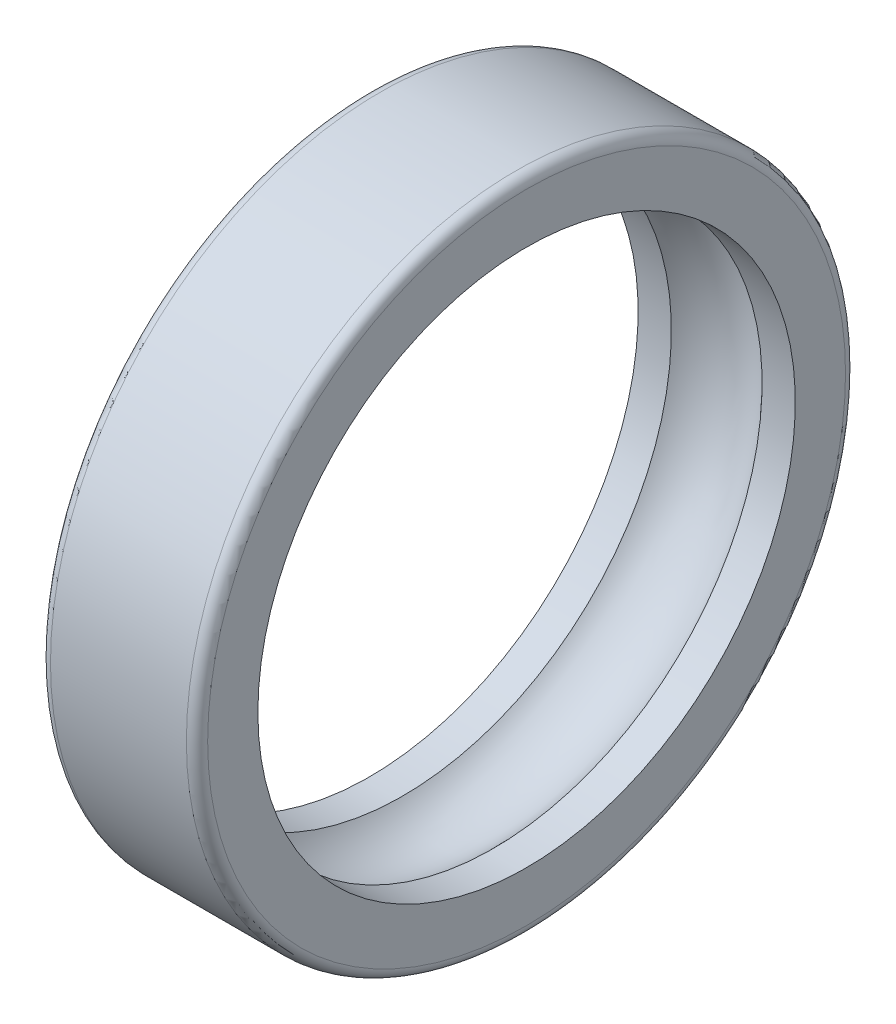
ISO-10303-21;
HEADER;
FILE_DESCRIPTION(('STEP AP214'),'2;1');
FILE_NAME('part.step','',(''),(''),'','','');
FILE_SCHEMA(('AUTOMOTIVE_DESIGN { 1 0 10303 214 1 1 1 1 }'));
ENDSEC;
DATA;
#1=APPLICATION_CONTEXT('core data for automotive mechanical design processes');
#2=APPLICATION_PROTOCOL_DEFINITION('international standard','automotive_design',2000,#1);
#3=PRODUCT_CONTEXT('',#1,'mechanical');
#4=PRODUCT('Part','Part','',(#3));
#5=PRODUCT_RELATED_PRODUCT_CATEGORY('part','',(#4));
#6=PRODUCT_DEFINITION_FORMATION('','',#4);
#7=PRODUCT_DEFINITION_CONTEXT('part definition',#1,'design');
#8=PRODUCT_DEFINITION('design','',#6,#7);
#9=PRODUCT_DEFINITION_SHAPE('','',#8);
#10=(LENGTH_UNIT() NAMED_UNIT(*) SI_UNIT(.MILLI.,.METRE.));
#11=(NAMED_UNIT(*) PLANE_ANGLE_UNIT() SI_UNIT($,.RADIAN.));
#12=(NAMED_UNIT(*) SI_UNIT($,.STERADIAN.) SOLID_ANGLE_UNIT());
#13=UNCERTAINTY_MEASURE_WITH_UNIT(LENGTH_MEASURE(1.E-05),#10,'distance_accuracy_value','');
#14=(GEOMETRIC_REPRESENTATION_CONTEXT(3) GLOBAL_UNCERTAINTY_ASSIGNED_CONTEXT((#13)) GLOBAL_UNIT_ASSIGNED_CONTEXT((#10,
#11,#12)) REPRESENTATION_CONTEXT('',''));
#15=CARTESIAN_POINT('',(0.,0.,0.));
#16=DIRECTION('',(0.,0.,1.));
#17=DIRECTION('',(1.,0.,0.));
#18=AXIS2_PLACEMENT_3D('',#15,#16,#17);
#19=CARTESIAN_POINT('',(15.5,53.,0.));
#20=DIRECTION('',(-1.,0.,0.));
#21=DIRECTION('',(0.,0.,1.));
#22=AXIS2_PLACEMENT_3D('',#19,#20,#21);
#23=PLANE('',#22);
#24=CARTESIAN_POINT('',(15.5,0.,0.));
#25=DIRECTION('',(-1.,0.,0.));
#26=DIRECTION('',(0.,0.,1.));
#27=AXIS2_PLACEMENT_3D('',#24,#25,#26);
#28=CIRCLE('',#27,62.9);
#29=CARTESIAN_POINT('',(15.5,0.,62.9));
#30=VERTEX_POINT('',#29);
#31=EDGE_CURVE('E40',#30,#30,#28,.F.);
#32=ORIENTED_EDGE('',*,*,#31,.T.);
#33=EDGE_LOOP('',(#32));
#34=FACE_BOUND('',#33,.T.);
#35=CARTESIAN_POINT('',(15.5,0.,0.));
#36=DIRECTION('',(-1.,0.,0.));
#37=DIRECTION('',(0.,0.,1.));
#38=AXIS2_PLACEMENT_3D('',#35,#36,#37);
#39=CIRCLE('',#38,53.);
#40=CARTESIAN_POINT('',(15.5,0.,53.));
#41=VERTEX_POINT('',#40);
#42=EDGE_CURVE('E62',#41,#41,#39,.T.);
#43=ORIENTED_EDGE('',*,*,#42,.T.);
#44=EDGE_LOOP('',(#43));
#45=FACE_BOUND('',#44,.T.);
#46=ADVANCED_FACE('F33',(#34,#45),#23,.F.);
#47=CARTESIAN_POINT('',(-9.50411522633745,0.,0.));
#48=DIRECTION('',(-1.,0.,0.));
#49=DIRECTION('',(0.,0.,1.));
#50=AXIS2_PLACEMENT_3D('',#47,#48,#49);
#51=CYLINDRICAL_SURFACE('',#50,65.);
#52=CARTESIAN_POINT('',(13.4,0.,0.));
#53=DIRECTION('',(-1.,0.,0.));
#54=DIRECTION('',(0.,0.,1.));
#55=AXIS2_PLACEMENT_3D('',#52,#53,#54);
#56=CIRCLE('',#55,65.);
#57=CARTESIAN_POINT('',(13.4,0.,65.));
#58=VERTEX_POINT('',#57);
#59=EDGE_CURVE('E44',#58,#58,#56,.T.);
#60=ORIENTED_EDGE('',*,*,#59,.T.);
#61=EDGE_LOOP('',(#60));
#62=FACE_BOUND('',#61,.T.);
#63=CARTESIAN_POINT('',(-13.4,0.,0.));
#64=DIRECTION('',(1.,0.,0.));
#65=DIRECTION('',(0.,0.,-1.));
#66=AXIS2_PLACEMENT_3D('',#63,#64,#65);
#67=CIRCLE('',#66,65.);
#68=CARTESIAN_POINT('',(-13.4,0.,-65.));
#69=VERTEX_POINT('',#68);
#70=EDGE_CURVE('E48',#69,#69,#67,.T.);
#71=ORIENTED_EDGE('',*,*,#70,.T.);
#72=EDGE_LOOP('',(#71));
#73=FACE_BOUND('',#72,.T.);
#74=ADVANCED_FACE('F88',(#62,#73),#51,.T.);
#75=CARTESIAN_POINT('',(-15.5,53.,0.));
#76=DIRECTION('',(1.,0.,0.));
#77=DIRECTION('',(0.,0.,-1.));
#78=AXIS2_PLACEMENT_3D('',#75,#76,#77);
#79=PLANE('',#78);
#80=CARTESIAN_POINT('',(-15.5,0.,0.));
#81=DIRECTION('',(1.,0.,0.));
#82=DIRECTION('',(0.,0.,-1.));
#83=AXIS2_PLACEMENT_3D('',#80,#81,#82);
#84=CIRCLE('',#83,62.9);
#85=CARTESIAN_POINT('',(-15.5,0.,-62.9));
#86=VERTEX_POINT('',#85);
#87=EDGE_CURVE('E10',#86,#86,#84,.F.);
#88=ORIENTED_EDGE('',*,*,#87,.T.);
#89=EDGE_LOOP('',(#88));
#90=FACE_BOUND('',#89,.T.);
#91=CARTESIAN_POINT('',(-15.5,0.,0.));
#92=DIRECTION('',(-1.,0.,0.));
#93=DIRECTION('',(0.,0.,1.));
#94=AXIS2_PLACEMENT_3D('',#91,#92,#93);
#95=CIRCLE('',#94,53.);
#96=CARTESIAN_POINT('',(-15.5,0.,53.));
#97=VERTEX_POINT('',#96);
#98=EDGE_CURVE('E53',#97,#97,#95,.T.);
#99=ORIENTED_EDGE('',*,*,#98,.F.);
#100=EDGE_LOOP('',(#99));
#101=FACE_BOUND('',#100,.T.);
#102=ADVANCED_FACE('F83',(#90,#101),#79,.F.);
#103=CARTESIAN_POINT('',(-9.50411522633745,0.,0.));
#104=DIRECTION('',(-1.,0.,0.));
#105=DIRECTION('',(0.,0.,1.));
#106=AXIS2_PLACEMENT_3D('',#103,#104,#105);
#107=CYLINDRICAL_SURFACE('',#106,53.);
#108=CARTESIAN_POINT('',(-8.94427190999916,0.,0.));
#109=DIRECTION('',(-1.,0.,0.));
#110=DIRECTION('',(0.,0.,1.));
#111=AXIS2_PLACEMENT_3D('',#108,#109,#110);
#112=CIRCLE('',#111,53.);
#113=CARTESIAN_POINT('',(-8.94427190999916,0.,53.));
#114=VERTEX_POINT('',#113);
#115=EDGE_CURVE('E56',#114,#114,#112,.T.);
#116=ORIENTED_EDGE('',*,*,#115,.F.);
#117=EDGE_LOOP('',(#116));
#118=FACE_BOUND('',#117,.T.);
#119=ORIENTED_EDGE('',*,*,#98,.T.);
#120=EDGE_LOOP('',(#119));
#121=FACE_BOUND('',#120,.T.);
#122=ADVANCED_FACE('F77',(#118,#121),#107,.F.);
#123=CARTESIAN_POINT('',(0.,0.,0.));
#124=DIRECTION('',(-1.,0.,0.));
#125=DIRECTION('',(0.,0.,1.));
#126=AXIS2_PLACEMENT_3D('',#123,#124,#125);
#127=TOROIDAL_SURFACE('',#126,45.,12.);
#128=CARTESIAN_POINT('',(8.94427190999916,0.,0.));
#129=DIRECTION('',(-1.,0.,0.));
#130=DIRECTION('',(0.,0.,1.));
#131=AXIS2_PLACEMENT_3D('',#128,#129,#130);
#132=CIRCLE('',#131,53.);
#133=CARTESIAN_POINT('',(8.94427190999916,0.,53.));
#134=VERTEX_POINT('',#133);
#135=EDGE_CURVE('E59',#134,#134,#132,.T.);
#136=ORIENTED_EDGE('',*,*,#135,.F.);
#137=EDGE_LOOP('',(#136));
#138=FACE_BOUND('',#137,.T.);
#139=ORIENTED_EDGE('',*,*,#115,.T.);
#140=EDGE_LOOP('',(#139));
#141=FACE_BOUND('',#140,.T.);
#142=ADVANCED_FACE('F71',(#138,#141),#127,.F.);
#143=CARTESIAN_POINT('',(-9.50411522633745,0.,0.));
#144=DIRECTION('',(-1.,0.,0.));
#145=DIRECTION('',(0.,0.,1.));
#146=AXIS2_PLACEMENT_3D('',#143,#144,#145);
#147=CYLINDRICAL_SURFACE('',#146,53.);
#148=ORIENTED_EDGE('',*,*,#42,.F.);
#149=EDGE_LOOP('',(#148));
#150=FACE_BOUND('',#149,.T.);
#151=ORIENTED_EDGE('',*,*,#135,.T.);
#152=EDGE_LOOP('',(#151));
#153=FACE_BOUND('',#152,.T.);
#154=ADVANCED_FACE('F67',(#150,#153),#147,.F.);
#155=CARTESIAN_POINT('',(13.4,0.,0.));
#156=DIRECTION('',(-1.,0.,0.));
#157=DIRECTION('',(0.,0.,1.));
#158=AXIS2_PLACEMENT_3D('',#155,#156,#157);
#159=TOROIDAL_SURFACE('',#158,62.9,2.1);
#160=ORIENTED_EDGE('',*,*,#31,.F.);
#161=EDGE_LOOP('',(#160));
#162=FACE_BOUND('',#161,.T.);
#163=ORIENTED_EDGE('',*,*,#59,.F.);
#164=EDGE_LOOP('',(#163));
#165=FACE_BOUND('',#164,.T.);
#166=ADVANCED_FACE('F70',(#162,#165),#159,.T.);
#167=CARTESIAN_POINT('',(-13.4,0.,0.));
#168=DIRECTION('',(1.,0.,0.));
#169=DIRECTION('',(0.,0.,-1.));
#170=AXIS2_PLACEMENT_3D('',#167,#168,#169);
#171=TOROIDAL_SURFACE('',#170,62.9,2.1);
#172=ORIENTED_EDGE('',*,*,#70,.F.);
#173=EDGE_LOOP('',(#172));
#174=FACE_BOUND('',#173,.T.);
#175=ORIENTED_EDGE('',*,*,#87,.F.);
#176=EDGE_LOOP('',(#175));
#177=FACE_BOUND('',#176,.T.);
#178=ADVANCED_FACE('F35',(#174,#177),#171,.T.);
#179=CLOSED_SHELL('',(#46,#74,#102,#122,#142,#154,#166,#178));
#180=MANIFOLD_SOLID_BREP('B2',#179);
#181=ADVANCED_BREP_SHAPE_REPRESENTATION('',(#18,#180),#14);
#182=SHAPE_DEFINITION_REPRESENTATION(#9,#181);
ENDSEC;
END-ISO-10303-21;
